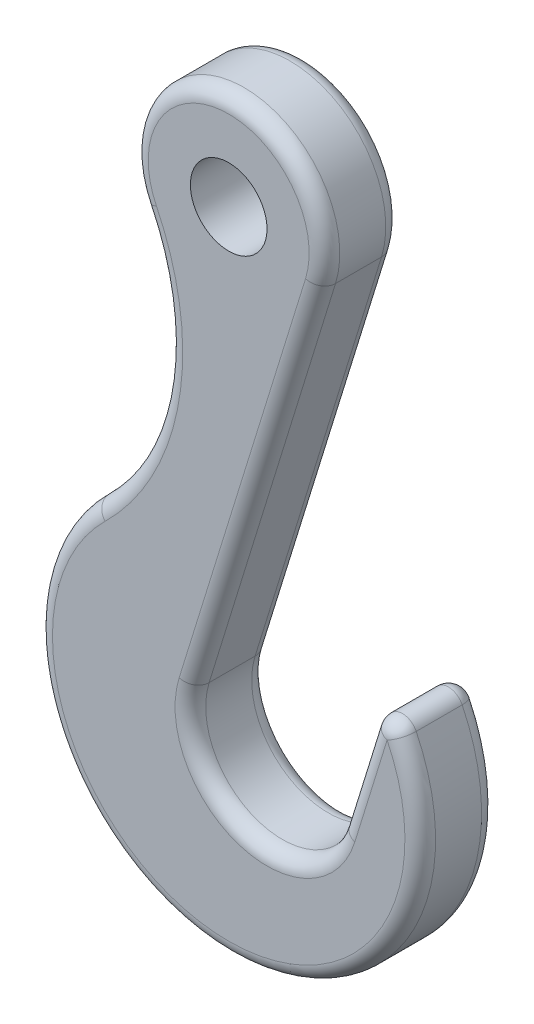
ISO-10303-21;
HEADER;
FILE_DESCRIPTION(('STEP AP214'),'2;1');
FILE_NAME('part.step','',(''),(''),'','','');
FILE_SCHEMA(('AUTOMOTIVE_DESIGN { 1 0 10303 214 1 1 1 1 }'));
ENDSEC;
DATA;
#1=APPLICATION_CONTEXT('core data for automotive mechanical design processes');
#2=APPLICATION_PROTOCOL_DEFINITION('international standard','automotive_design',2000,#1);
#3=PRODUCT_CONTEXT('',#1,'mechanical');
#4=PRODUCT('Part','Part','',(#3));
#5=PRODUCT_RELATED_PRODUCT_CATEGORY('part','',(#4));
#6=PRODUCT_DEFINITION_FORMATION('','',#4);
#7=PRODUCT_DEFINITION_CONTEXT('part definition',#1,'design');
#8=PRODUCT_DEFINITION('design','',#6,#7);
#9=PRODUCT_DEFINITION_SHAPE('','',#8);
#10=(LENGTH_UNIT() NAMED_UNIT(*) SI_UNIT(.MILLI.,.METRE.));
#11=(NAMED_UNIT(*) PLANE_ANGLE_UNIT() SI_UNIT($,.RADIAN.));
#12=(NAMED_UNIT(*) SI_UNIT($,.STERADIAN.) SOLID_ANGLE_UNIT());
#13=UNCERTAINTY_MEASURE_WITH_UNIT(LENGTH_MEASURE(1.E-05),#10,'distance_accuracy_value','');
#14=(GEOMETRIC_REPRESENTATION_CONTEXT(3) GLOBAL_UNCERTAINTY_ASSIGNED_CONTEXT((#13)) GLOBAL_UNIT_ASSIGNED_CONTEXT((#10,
#11,#12)) REPRESENTATION_CONTEXT('',''));
#15=CARTESIAN_POINT('',(0.,0.,0.));
#16=DIRECTION('',(0.,0.,1.));
#17=DIRECTION('',(1.,0.,0.));
#18=AXIS2_PLACEMENT_3D('',#15,#16,#17);
#19=CARTESIAN_POINT('',(0.,60.,10.));
#20=DIRECTION('',(0.,0.,1.));
#21=DIRECTION('',(1.,0.,0.));
#22=AXIS2_PLACEMENT_3D('',#19,#20,#21);
#23=PLANE('',#22);
#24=CARTESIAN_POINT('',(0.,0.,10.));
#25=DIRECTION('',(0.,0.,1.));
#26=DIRECTION('',(1.,0.,0.));
#27=AXIS2_PLACEMENT_3D('',#24,#25,#26);
#28=CIRCLE('',#27,23.);
#29=CARTESIAN_POINT('',(-16.1203186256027,16.4053444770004,10.));
#30=VERTEX_POINT('',#29);
#31=CARTESIAN_POINT('',(20.6756526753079,10.0755836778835,10.));
#32=VERTEX_POINT('',#31);
#33=EDGE_CURVE('E49',#30,#32,#28,.T.);
#34=ORIENTED_EDGE('',*,*,#33,.T.);
#35=DIRECTION('',(-0.295385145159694,-0.955378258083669,0.));
#36=VECTOR('',#35,1.);
#37=CARTESIAN_POINT('',(16.464539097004,-3.54462174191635,10.));
#38=LINE('',#37,#36);
#39=CARTESIAN_POINT('',(16.464539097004,-3.54462174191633,10.));
#40=VERTEX_POINT('',#39);
#41=EDGE_CURVE('E190',#32,#40,#38,.T.);
#42=ORIENTED_EDGE('',*,*,#41,.T.);
#43=CARTESIAN_POINT('',(5.,0.,10.));
#44=DIRECTION('',(0.,0.,1.));
#45=DIRECTION('',(1.,0.,0.));
#46=AXIS2_PLACEMENT_3D('',#43,#44,#45);
#47=CIRCLE('',#46,12.);
#48=CARTESIAN_POINT('',(-6.46453909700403,3.54462174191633,10.));
#49=VERTEX_POINT('',#48);
#50=EDGE_CURVE('E198',#40,#49,#47,.F.);
#51=ORIENTED_EDGE('',*,*,#50,.T.);
#52=DIRECTION('',(0.295385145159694,0.955378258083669,0.));
#53=VECTOR('',#52,1.);
#54=CARTESIAN_POINT('',(10.0314717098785,56.8984559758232,10.));
#55=LINE('',#54,#53);
#56=CARTESIAN_POINT('',(10.0314717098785,56.8984559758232,10.));
#57=VERTEX_POINT('',#56);
#58=EDGE_CURVE('E196',#49,#57,#55,.T.);
#59=ORIENTED_EDGE('',*,*,#58,.T.);
#60=CARTESIAN_POINT('',(0.,60.,10.));
#61=DIRECTION('',(0.,0.,1.));
#62=DIRECTION('',(1.,0.,0.));
#63=AXIS2_PLACEMENT_3D('',#60,#61,#62);
#64=CIRCLE('',#63,10.5);
#65=CARTESIAN_POINT('',(-9.43422721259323,55.3907314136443,10.));
#66=VERTEX_POINT('',#65);
#67=EDGE_CURVE('E194',#57,#66,#64,.T.);
#68=ORIENTED_EDGE('',*,*,#67,.T.);
#69=CARTESIAN_POINT('',(-39.8340274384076,40.5383390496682,10.));
#70=DIRECTION('',(0.,0.,1.));
#71=DIRECTION('',(1.,0.,0.));
#72=AXIS2_PLACEMENT_3D('',#69,#70,#71);
#73=CIRCLE('',#72,33.8340274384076);
#74=EDGE_CURVE('E54',#66,#30,#73,.F.);
#75=ORIENTED_EDGE('',*,*,#74,.T.);
#76=EDGE_LOOP('',(#34,#42,#51,#59,#68,#75));
#77=FACE_BOUND('',#76,.T.);
#78=CARTESIAN_POINT('',(0.,60.,10.));
#79=DIRECTION('',(0.,0.,1.));
#80=DIRECTION('',(1.,0.,0.));
#81=AXIS2_PLACEMENT_3D('',#78,#79,#80);
#82=CIRCLE('',#81,5.);
#83=CARTESIAN_POINT('',(5.,60.,10.));
#84=VERTEX_POINT('',#83);
#85=EDGE_CURVE('E248',#84,#84,#82,.T.);
#86=ORIENTED_EDGE('',*,*,#85,.F.);
#87=EDGE_LOOP('',(#86));
#88=FACE_BOUND('',#87,.T.);
#89=ADVANCED_FACE('F32',(#77,#88),#23,.T.);
#90=CARTESIAN_POINT('',(0.,60.,0.));
#91=DIRECTION('',(0.,0.,1.));
#92=DIRECTION('',(1.,0.,0.));
#93=AXIS2_PLACEMENT_3D('',#90,#91,#92);
#94=PLANE('',#93);
#95=CARTESIAN_POINT('',(0.,0.,0.));
#96=DIRECTION('',(0.,0.,1.));
#97=DIRECTION('',(1.,0.,0.));
#98=AXIS2_PLACEMENT_3D('',#95,#96,#97);
#99=CIRCLE('',#98,23.);
#100=CARTESIAN_POINT('',(20.6756526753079,10.0755836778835,0.));
#101=VERTEX_POINT('',#100);
#102=CARTESIAN_POINT('',(-16.1203186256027,16.4053444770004,0.));
#103=VERTEX_POINT('',#102);
#104=EDGE_CURVE('E232',#101,#103,#99,.F.);
#105=ORIENTED_EDGE('',*,*,#104,.T.);
#106=CARTESIAN_POINT('',(-39.8340274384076,40.5383390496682,0.));
#107=DIRECTION('',(0.,0.,1.));
#108=DIRECTION('',(1.,0.,0.));
#109=AXIS2_PLACEMENT_3D('',#106,#107,#108);
#110=CIRCLE('',#109,33.8340274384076);
#111=CARTESIAN_POINT('',(-9.43422721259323,55.3907314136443,0.));
#112=VERTEX_POINT('',#111);
#113=EDGE_CURVE('E221',#103,#112,#110,.T.);
#114=ORIENTED_EDGE('',*,*,#113,.T.);
#115=CARTESIAN_POINT('',(0.,60.,0.));
#116=DIRECTION('',(0.,0.,1.));
#117=DIRECTION('',(1.,0.,0.));
#118=AXIS2_PLACEMENT_3D('',#115,#116,#117);
#119=CIRCLE('',#118,10.5);
#120=CARTESIAN_POINT('',(10.0314717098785,56.8984559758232,0.));
#121=VERTEX_POINT('',#120);
#122=EDGE_CURVE('E224',#112,#121,#119,.F.);
#123=ORIENTED_EDGE('',*,*,#122,.T.);
#124=DIRECTION('',(0.295385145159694,0.955378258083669,0.));
#125=VECTOR('',#124,1.);
#126=CARTESIAN_POINT('',(10.0314717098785,56.8984559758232,0.));
#127=LINE('',#126,#125);
#128=CARTESIAN_POINT('',(-6.46453909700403,3.54462174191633,0.));
#129=VERTEX_POINT('',#128);
#130=EDGE_CURVE('E226',#121,#129,#127,.F.);
#131=ORIENTED_EDGE('',*,*,#130,.T.);
#132=CARTESIAN_POINT('',(5.,0.,0.));
#133=DIRECTION('',(0.,0.,1.));
#134=DIRECTION('',(1.,0.,0.));
#135=AXIS2_PLACEMENT_3D('',#132,#133,#134);
#136=CIRCLE('',#135,12.);
#137=CARTESIAN_POINT('',(16.464539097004,-3.54462174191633,0.));
#138=VERTEX_POINT('',#137);
#139=EDGE_CURVE('E228',#129,#138,#136,.T.);
#140=ORIENTED_EDGE('',*,*,#139,.T.);
#141=DIRECTION('',(-0.295385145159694,-0.955378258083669,0.));
#142=VECTOR('',#141,1.);
#143=CARTESIAN_POINT('',(32.9605499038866,49.8092124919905,0.));
#144=LINE('',#143,#142);
#145=EDGE_CURVE('E230',#138,#101,#144,.F.);
#146=ORIENTED_EDGE('',*,*,#145,.T.);
#147=EDGE_LOOP('',(#105,#114,#123,#131,#140,#146));
#148=FACE_BOUND('',#147,.T.);
#149=CARTESIAN_POINT('',(0.,60.,0.));
#150=DIRECTION('',(0.,0.,1.));
#151=DIRECTION('',(1.,0.,0.));
#152=AXIS2_PLACEMENT_3D('',#149,#150,#151);
#153=CIRCLE('',#152,5.);
#154=CARTESIAN_POINT('',(5.,60.,0.));
#155=VERTEX_POINT('',#154);
#156=EDGE_CURVE('E173',#155,#155,#153,.T.);
#157=ORIENTED_EDGE('',*,*,#156,.T.);
#158=EDGE_LOOP('',(#157));
#159=FACE_BOUND('',#158,.T.);
#160=ADVANCED_FACE('F258',(#148,#159),#94,.F.);
#161=CARTESIAN_POINT('',(0.,60.,10.));
#162=DIRECTION('',(0.,0.,-1.));
#163=DIRECTION('',(-1.,0.,0.));
#164=AXIS2_PLACEMENT_3D('',#161,#162,#163);
#165=CYLINDRICAL_SURFACE('',#164,12.5);
#166=DIRECTION('',(0.,0.,-1.));
#167=VECTOR('',#166,1.);
#168=CARTESIAN_POINT('',(11.9422282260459,56.3076856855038,10.));
#169=LINE('',#168,#167);
#170=CARTESIAN_POINT('',(11.9422282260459,56.3076856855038,8.));
#171=VERTEX_POINT('',#170);
#172=CARTESIAN_POINT('',(11.9422282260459,56.3076856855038,2.));
#173=VERTEX_POINT('',#172);
#174=EDGE_CURVE('E245',#171,#173,#169,.T.);
#175=ORIENTED_EDGE('',*,*,#174,.T.);
#176=CARTESIAN_POINT('',(0.,60.,2.));
#177=DIRECTION('',(0.,0.,1.));
#178=DIRECTION('',(1.,0.,0.));
#179=AXIS2_PLACEMENT_3D('',#176,#177,#178);
#180=CIRCLE('',#179,12.5);
#181=CARTESIAN_POINT('',(-11.2312228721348,54.5127754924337,2.));
#182=VERTEX_POINT('',#181);
#183=EDGE_CURVE('E217',#173,#182,#180,.T.);
#184=ORIENTED_EDGE('',*,*,#183,.T.);
#185=DIRECTION('',(0.,0.,-1.));
#186=VECTOR('',#185,1.);
#187=CARTESIAN_POINT('',(-11.2312228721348,54.5127754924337,10.));
#188=LINE('',#187,#186);
#189=CARTESIAN_POINT('',(-11.2312228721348,54.5127754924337,8.));
#190=VERTEX_POINT('',#189);
#191=EDGE_CURVE('E146',#190,#182,#188,.T.);
#192=ORIENTED_EDGE('',*,*,#191,.F.);
#193=CARTESIAN_POINT('',(0.,60.,8.));
#194=DIRECTION('',(0.,0.,1.));
#195=DIRECTION('',(1.,0.,0.));
#196=AXIS2_PLACEMENT_3D('',#193,#194,#195);
#197=CIRCLE('',#196,12.5);
#198=EDGE_CURVE('E219',#190,#171,#197,.F.);
#199=ORIENTED_EDGE('',*,*,#198,.T.);
#200=EDGE_LOOP('',(#175,#184,#192,#199));
#201=FACE_BOUND('',#200,.T.);
#202=ADVANCED_FACE('F263',(#201),#165,.T.);
#203=CARTESIAN_POINT('',(-39.8340274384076,40.5383390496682,10.));
#204=DIRECTION('',(0.,0.,-1.));
#205=DIRECTION('',(-1.,0.,0.));
#206=AXIS2_PLACEMENT_3D('',#203,#204,#205);
#207=CYLINDRICAL_SURFACE('',#206,31.8340274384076);
#208=ORIENTED_EDGE('',*,*,#191,.T.);
#209=CARTESIAN_POINT('',(-39.8340274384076,40.5383390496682,2.));
#210=DIRECTION('',(0.,0.,1.));
#211=DIRECTION('',(1.,0.,0.));
#212=AXIS2_PLACEMENT_3D('',#209,#210,#211);
#213=CIRCLE('',#212,31.8340274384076);
#214=CARTESIAN_POINT('',(-17.5220854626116,17.8318961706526,2.));
#215=VERTEX_POINT('',#214);
#216=EDGE_CURVE('E145',#182,#215,#213,.F.);
#217=ORIENTED_EDGE('',*,*,#216,.T.);
#218=DIRECTION('',(0.,0.,-1.));
#219=VECTOR('',#218,1.);
#220=CARTESIAN_POINT('',(-17.5220854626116,17.8318961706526,10.));
#221=LINE('',#220,#219);
#222=CARTESIAN_POINT('',(-17.5220854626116,17.8318961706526,8.));
#223=VERTEX_POINT('',#222);
#224=EDGE_CURVE('E131',#223,#215,#221,.T.);
#225=ORIENTED_EDGE('',*,*,#224,.F.);
#226=CARTESIAN_POINT('',(-39.8340274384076,40.5383390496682,8.));
#227=DIRECTION('',(0.,0.,1.));
#228=DIRECTION('',(1.,0.,0.));
#229=AXIS2_PLACEMENT_3D('',#226,#227,#228);
#230=CIRCLE('',#229,31.8340274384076);
#231=EDGE_CURVE('E142',#223,#190,#230,.T.);
#232=ORIENTED_EDGE('',*,*,#231,.T.);
#233=EDGE_LOOP('',(#208,#217,#225,#232));
#234=FACE_BOUND('',#233,.T.);
#235=ADVANCED_FACE('F141',(#234),#207,.F.);
#236=CARTESIAN_POINT('',(0.,0.,10.));
#237=DIRECTION('',(0.,0.,-1.));
#238=DIRECTION('',(-1.,0.,0.));
#239=AXIS2_PLACEMENT_3D('',#236,#237,#238);
#240=CYLINDRICAL_SURFACE('',#239,25.);
#241=DIRECTION('',(0.,0.,-1.));
#242=VECTOR('',#241,1.);
#243=CARTESIAN_POINT('',(22.473535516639,10.9517213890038,10.));
#244=LINE('',#243,#242);
#245=CARTESIAN_POINT('',(22.473535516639,10.9517213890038,2.));
#246=VERTEX_POINT('',#245);
#247=CARTESIAN_POINT('',(22.473535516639,10.9517213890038,8.));
#248=VERTEX_POINT('',#247);
#249=EDGE_CURVE('E133',#246,#248,#244,.F.);
#250=ORIENTED_EDGE('',*,*,#249,.T.);
#251=CARTESIAN_POINT('',(0.,0.,8.));
#252=DIRECTION('',(0.,0.,1.));
#253=DIRECTION('',(1.,0.,0.));
#254=AXIS2_PLACEMENT_3D('',#251,#252,#253);
#255=CIRCLE('',#254,25.);
#256=EDGE_CURVE('E11',#248,#223,#255,.F.);
#257=ORIENTED_EDGE('',*,*,#256,.T.);
#258=ORIENTED_EDGE('',*,*,#224,.T.);
#259=CARTESIAN_POINT('',(0.,0.,2.));
#260=DIRECTION('',(0.,0.,1.));
#261=DIRECTION('',(1.,0.,0.));
#262=AXIS2_PLACEMENT_3D('',#259,#260,#261);
#263=CIRCLE('',#262,25.);
#264=EDGE_CURVE('E41',#215,#246,#263,.T.);
#265=ORIENTED_EDGE('',*,*,#264,.T.);
#266=EDGE_LOOP('',(#250,#257,#258,#265));
#267=FACE_BOUND('',#266,.T.);
#268=ADVANCED_FACE('F130',(#267),#240,.T.);
#269=CARTESIAN_POINT('',(14.5537825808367,-2.95385145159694,10.));
#270=DIRECTION('',(0.955378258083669,-0.295385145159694,0.));
#271=DIRECTION('',(0.295385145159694,0.955378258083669,0.));
#272=AXIS2_PLACEMENT_3D('',#269,#270,#271);
#273=PLANE('',#272);
#274=DIRECTION('',(0.,0.,-1.));
#275=VECTOR('',#274,1.);
#276=CARTESIAN_POINT('',(18.7648961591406,10.6663539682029,10.));
#277=LINE('',#276,#275);
#278=CARTESIAN_POINT('',(18.7648961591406,10.6663539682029,8.));
#279=VERTEX_POINT('',#278);
#280=CARTESIAN_POINT('',(18.7648961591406,10.6663539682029,2.));
#281=VERTEX_POINT('',#280);
#282=EDGE_CURVE('E236',#279,#281,#277,.T.);
#283=ORIENTED_EDGE('',*,*,#282,.T.);
#284=DIRECTION('',(-0.295385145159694,-0.955378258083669,0.));
#285=VECTOR('',#284,1.);
#286=CARTESIAN_POINT('',(14.5537825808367,-2.95385145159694,2.));
#287=LINE('',#286,#285);
#288=CARTESIAN_POINT('',(14.5537825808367,-2.95385145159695,2.));
#289=VERTEX_POINT('',#288);
#290=EDGE_CURVE('E204',#281,#289,#287,.T.);
#291=ORIENTED_EDGE('',*,*,#290,.T.);
#292=DIRECTION('',(0.,0.,-1.));
#293=VECTOR('',#292,1.);
#294=CARTESIAN_POINT('',(14.5537825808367,-2.95385145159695,10.));
#295=LINE('',#294,#293);
#296=CARTESIAN_POINT('',(14.5537825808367,-2.95385145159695,8.));
#297=VERTEX_POINT('',#296);
#298=EDGE_CURVE('E147',#297,#289,#295,.T.);
#299=ORIENTED_EDGE('',*,*,#298,.F.);
#300=DIRECTION('',(-0.295385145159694,-0.955378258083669,0.));
#301=VECTOR('',#300,1.);
#302=CARTESIAN_POINT('',(18.7648961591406,10.6663539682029,8.));
#303=LINE('',#302,#301);
#304=EDGE_CURVE('E206',#297,#279,#303,.F.);
#305=ORIENTED_EDGE('',*,*,#304,.T.);
#306=EDGE_LOOP('',(#283,#291,#299,#305));
#307=FACE_BOUND('',#306,.T.);
#308=ADVANCED_FACE('F275',(#307),#273,.F.);
#309=CARTESIAN_POINT('',(5.,0.,10.));
#310=DIRECTION('',(0.,0.,-1.));
#311=DIRECTION('',(-1.,0.,0.));
#312=AXIS2_PLACEMENT_3D('',#309,#310,#311);
#313=CYLINDRICAL_SURFACE('',#312,10.);
#314=ORIENTED_EDGE('',*,*,#298,.T.);
#315=CARTESIAN_POINT('',(5.,0.,2.));
#316=DIRECTION('',(0.,0.,1.));
#317=DIRECTION('',(1.,0.,0.));
#318=AXIS2_PLACEMENT_3D('',#315,#316,#317);
#319=CIRCLE('',#318,10.);
#320=CARTESIAN_POINT('',(-4.55378258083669,2.95385145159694,2.));
#321=VERTEX_POINT('',#320);
#322=EDGE_CURVE('E209',#289,#321,#319,.F.);
#323=ORIENTED_EDGE('',*,*,#322,.T.);
#324=DIRECTION('',(0.,0.,-1.));
#325=VECTOR('',#324,1.);
#326=CARTESIAN_POINT('',(-4.55378258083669,2.95385145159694,10.));
#327=LINE('',#326,#325);
#328=CARTESIAN_POINT('',(-4.55378258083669,2.95385145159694,8.));
#329=VERTEX_POINT('',#328);
#330=EDGE_CURVE('E242',#329,#321,#327,.T.);
#331=ORIENTED_EDGE('',*,*,#330,.F.);
#332=CARTESIAN_POINT('',(5.,0.,8.));
#333=DIRECTION('',(0.,0.,1.));
#334=DIRECTION('',(1.,0.,0.));
#335=AXIS2_PLACEMENT_3D('',#332,#333,#334);
#336=CIRCLE('',#335,10.);
#337=EDGE_CURVE('E211',#329,#297,#336,.T.);
#338=ORIENTED_EDGE('',*,*,#337,.T.);
#339=EDGE_LOOP('',(#314,#323,#331,#338));
#340=FACE_BOUND('',#339,.T.);
#341=ADVANCED_FACE('F271',(#340),#313,.F.);
#342=CARTESIAN_POINT('',(11.9422282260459,56.3076856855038,10.));
#343=DIRECTION('',(-0.955378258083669,0.295385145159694,0.));
#344=DIRECTION('',(-0.295385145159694,-0.955378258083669,0.));
#345=AXIS2_PLACEMENT_3D('',#342,#343,#344);
#346=PLANE('',#345);
#347=ORIENTED_EDGE('',*,*,#330,.T.);
#348=DIRECTION('',(0.295385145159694,0.955378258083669,0.));
#349=VECTOR('',#348,1.);
#350=CARTESIAN_POINT('',(11.9422282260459,56.3076856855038,2.));
#351=LINE('',#350,#349);
#352=EDGE_CURVE('E213',#321,#173,#351,.T.);
#353=ORIENTED_EDGE('',*,*,#352,.T.);
#354=ORIENTED_EDGE('',*,*,#174,.F.);
#355=DIRECTION('',(0.295385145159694,0.955378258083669,0.));
#356=VECTOR('',#355,1.);
#357=CARTESIAN_POINT('',(-4.5537825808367,2.95385145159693,8.));
#358=LINE('',#357,#356);
#359=EDGE_CURVE('E215',#171,#329,#358,.F.);
#360=ORIENTED_EDGE('',*,*,#359,.T.);
#361=EDGE_LOOP('',(#347,#353,#354,#360));
#362=FACE_BOUND('',#361,.T.);
#363=ADVANCED_FACE('F268',(#362),#346,.F.);
#364=CARTESIAN_POINT('',(0.,60.,10.));
#365=DIRECTION('',(0.,0.,-1.));
#366=DIRECTION('',(-1.,0.,0.));
#367=AXIS2_PLACEMENT_3D('',#364,#365,#366);
#368=CYLINDRICAL_SURFACE('',#367,5.);
#369=ORIENTED_EDGE('',*,*,#85,.T.);
#370=EDGE_LOOP('',(#369));
#371=FACE_BOUND('',#370,.T.);
#372=ORIENTED_EDGE('',*,*,#156,.F.);
#373=EDGE_LOOP('',(#372));
#374=FACE_BOUND('',#373,.T.);
#375=ADVANCED_FACE('F254',(#371,#374),#368,.F.);
#376=CARTESIAN_POINT('',(20.6756526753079,10.0755836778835,10.));
#377=DIRECTION('',(0.,0.,-1.));
#378=DIRECTION('',(-1.,0.,0.));
#379=AXIS2_PLACEMENT_3D('',#376,#377,#378);
#380=CYLINDRICAL_SURFACE('',#379,2.);
#381=ORIENTED_EDGE('',*,*,#249,.F.);
#382=CARTESIAN_POINT('',(20.6756526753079,10.0755836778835,2.));
#383=DIRECTION('',(0.,0.,-1.));
#384=DIRECTION('',(-1.,0.,0.));
#385=AXIS2_PLACEMENT_3D('',#382,#383,#384);
#386=CIRCLE('',#385,2.);
#387=EDGE_CURVE('E200',#246,#281,#386,.F.);
#388=ORIENTED_EDGE('',*,*,#387,.T.);
#389=ORIENTED_EDGE('',*,*,#282,.F.);
#390=CARTESIAN_POINT('',(20.6756526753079,10.0755836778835,8.));
#391=DIRECTION('',(0.,0.,-1.));
#392=DIRECTION('',(-1.,0.,0.));
#393=AXIS2_PLACEMENT_3D('',#390,#391,#392);
#394=CIRCLE('',#393,2.);
#395=EDGE_CURVE('E202',#279,#248,#394,.T.);
#396=ORIENTED_EDGE('',*,*,#395,.T.);
#397=EDGE_LOOP('',(#381,#388,#389,#396));
#398=FACE_BOUND('',#397,.T.);
#399=ADVANCED_FACE('F287',(#398),#380,.T.);
#400=CARTESIAN_POINT('',(5.,0.,2.));
#401=DIRECTION('',(0.,0.,1.));
#402=DIRECTION('',(1.,0.,0.));
#403=AXIS2_PLACEMENT_3D('',#400,#401,#402);
#404=TOROIDAL_SURFACE('',#403,12.,2.);
#405=CARTESIAN_POINT('',(-6.46453909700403,3.54462174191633,2.));
#406=DIRECTION('',(0.295385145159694,0.955378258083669,0.));
#407=DIRECTION('',(-0.955378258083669,0.295385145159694,0.));
#408=AXIS2_PLACEMENT_3D('',#405,#406,#407);
#409=CIRCLE('',#408,2.);
#410=EDGE_CURVE('E174',#321,#129,#409,.T.);
#411=ORIENTED_EDGE('',*,*,#410,.F.);
#412=ORIENTED_EDGE('',*,*,#322,.F.);
#413=CARTESIAN_POINT('',(16.464539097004,-3.54462174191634,2.));
#414=DIRECTION('',(0.295385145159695,0.955378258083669,0.));
#415=DIRECTION('',(-0.955378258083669,0.295385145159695,0.));
#416=AXIS2_PLACEMENT_3D('',#413,#414,#415);
#417=CIRCLE('',#416,2.);
#418=EDGE_CURVE('E170',#138,#289,#417,.T.);
#419=ORIENTED_EDGE('',*,*,#418,.F.);
#420=ORIENTED_EDGE('',*,*,#139,.F.);
#421=EDGE_LOOP('',(#411,#412,#419,#420));
#422=FACE_BOUND('',#421,.T.);
#423=ADVANCED_FACE('F290',(#422),#404,.T.);
#424=CARTESIAN_POINT('',(16.464539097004,-3.54462174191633,2.));
#425=DIRECTION('',(-0.295385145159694,-0.955378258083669,0.));
#426=DIRECTION('',(0.955378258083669,-0.295385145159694,0.));
#427=AXIS2_PLACEMENT_3D('',#424,#425,#426);
#428=CYLINDRICAL_SURFACE('',#427,2.);
#429=ORIENTED_EDGE('',*,*,#418,.T.);
#430=ORIENTED_EDGE('',*,*,#290,.F.);
#431=CARTESIAN_POINT('',(20.6756526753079,10.0755836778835,2.));
#432=DIRECTION('',(0.295385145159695,0.955378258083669,0.));
#433=DIRECTION('',(-0.955378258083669,0.295385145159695,0.));
#434=AXIS2_PLACEMENT_3D('',#431,#432,#433);
#435=CIRCLE('',#434,2.);
#436=EDGE_CURVE('E177',#101,#281,#435,.T.);
#437=ORIENTED_EDGE('',*,*,#436,.F.);
#438=ORIENTED_EDGE('',*,*,#145,.F.);
#439=EDGE_LOOP('',(#429,#430,#437,#438));
#440=FACE_BOUND('',#439,.T.);
#441=ADVANCED_FACE('F311',(#440),#428,.T.);
#442=CARTESIAN_POINT('',(10.0314717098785,56.8984559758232,2.));
#443=DIRECTION('',(0.295385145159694,0.955378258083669,0.));
#444=DIRECTION('',(-0.955378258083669,0.295385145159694,0.));
#445=AXIS2_PLACEMENT_3D('',#442,#443,#444);
#446=CYLINDRICAL_SURFACE('',#445,2.);
#447=ORIENTED_EDGE('',*,*,#410,.T.);
#448=ORIENTED_EDGE('',*,*,#130,.F.);
#449=CARTESIAN_POINT('',(10.0314717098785,56.8984559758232,2.));
#450=DIRECTION('',(0.295385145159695,0.955378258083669,0.));
#451=DIRECTION('',(-0.955378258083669,0.295385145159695,0.));
#452=AXIS2_PLACEMENT_3D('',#449,#450,#451);
#453=CIRCLE('',#452,2.);
#454=EDGE_CURVE('E180',#173,#121,#453,.T.);
#455=ORIENTED_EDGE('',*,*,#454,.F.);
#456=ORIENTED_EDGE('',*,*,#352,.F.);
#457=EDGE_LOOP('',(#447,#448,#455,#456));
#458=FACE_BOUND('',#457,.T.);
#459=ADVANCED_FACE('F307',(#458),#446,.T.);
#460=CARTESIAN_POINT('',(20.6756526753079,10.0755836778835,2.));
#461=DIRECTION('',(0.,0.,1.));
#462=DIRECTION('',(1.,0.,0.));
#463=AXIS2_PLACEMENT_3D('',#460,#461,#462);
#464=SPHERICAL_SURFACE('',#463,2.);
#465=ORIENTED_EDGE('',*,*,#436,.T.);
#466=ORIENTED_EDGE('',*,*,#387,.F.);
#467=CARTESIAN_POINT('',(20.6756526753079,10.0755836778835,2.));
#468=DIRECTION('',(0.438068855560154,-0.898941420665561,0.));
#469=DIRECTION('',(0.898941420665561,0.438068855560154,0.));
#470=AXIS2_PLACEMENT_3D('',#467,#468,#469);
#471=CIRCLE('',#470,2.);
#472=EDGE_CURVE('E183',#101,#246,#471,.T.);
#473=ORIENTED_EDGE('',*,*,#472,.F.);
#474=EDGE_LOOP('',(#465,#466,#473));
#475=FACE_BOUND('',#474,.T.);
#476=ADVANCED_FACE('F303',(#475),#464,.T.);
#477=CARTESIAN_POINT('',(0.,60.,2.));
#478=DIRECTION('',(0.,0.,1.));
#479=DIRECTION('',(1.,0.,0.));
#480=AXIS2_PLACEMENT_3D('',#477,#478,#479);
#481=TOROIDAL_SURFACE('',#480,10.5,2.);
#482=ORIENTED_EDGE('',*,*,#454,.T.);
#483=ORIENTED_EDGE('',*,*,#122,.F.);
#484=CARTESIAN_POINT('',(-9.43422721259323,55.3907314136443,2.));
#485=DIRECTION('',(0.438977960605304,-0.898497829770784,0.));
#486=DIRECTION('',(0.898497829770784,0.438977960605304,0.));
#487=AXIS2_PLACEMENT_3D('',#484,#485,#486);
#488=CIRCLE('',#487,2.);
#489=EDGE_CURVE('E186',#182,#112,#488,.T.);
#490=ORIENTED_EDGE('',*,*,#489,.F.);
#491=ORIENTED_EDGE('',*,*,#183,.F.);
#492=EDGE_LOOP('',(#482,#483,#490,#491));
#493=FACE_BOUND('',#492,.T.);
#494=ADVANCED_FACE('F299',(#493),#481,.T.);
#495=CARTESIAN_POINT('',(0.,0.,2.));
#496=DIRECTION('',(0.,0.,1.));
#497=DIRECTION('',(1.,0.,0.));
#498=AXIS2_PLACEMENT_3D('',#495,#496,#497);
#499=TOROIDAL_SURFACE('',#498,23.,2.);
#500=ORIENTED_EDGE('',*,*,#472,.T.);
#501=ORIENTED_EDGE('',*,*,#264,.F.);
#502=CARTESIAN_POINT('',(-16.1203186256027,16.4053444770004,2.));
#503=DIRECTION('',(0.713275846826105,0.700883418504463,0.));
#504=DIRECTION('',(-0.700883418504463,0.713275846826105,0.));
#505=AXIS2_PLACEMENT_3D('',#502,#503,#504);
#506=CIRCLE('',#505,2.);
#507=EDGE_CURVE('E157',#103,#215,#506,.T.);
#508=ORIENTED_EDGE('',*,*,#507,.F.);
#509=ORIENTED_EDGE('',*,*,#104,.F.);
#510=EDGE_LOOP('',(#500,#501,#508,#509));
#511=FACE_BOUND('',#510,.T.);
#512=ADVANCED_FACE('F295',(#511),#499,.T.);
#513=CARTESIAN_POINT('',(-39.8340274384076,40.5383390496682,2.));
#514=DIRECTION('',(0.,0.,1.));
#515=DIRECTION('',(1.,0.,0.));
#516=AXIS2_PLACEMENT_3D('',#513,#514,#515);
#517=TOROIDAL_SURFACE('',#516,33.8340274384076,2.);
#518=ORIENTED_EDGE('',*,*,#489,.T.);
#519=ORIENTED_EDGE('',*,*,#113,.F.);
#520=ORIENTED_EDGE('',*,*,#507,.T.);
#521=ORIENTED_EDGE('',*,*,#216,.F.);
#522=EDGE_LOOP('',(#518,#519,#520,#521));
#523=FACE_BOUND('',#522,.T.);
#524=ADVANCED_FACE('F292',(#523),#517,.T.);
#525=CARTESIAN_POINT('',(-39.8340274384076,40.5383390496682,8.));
#526=DIRECTION('',(0.,0.,1.));
#527=DIRECTION('',(1.,0.,0.));
#528=AXIS2_PLACEMENT_3D('',#525,#526,#527);
#529=TOROIDAL_SURFACE('',#528,33.8340274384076,2.);
#530=CARTESIAN_POINT('',(-16.1203186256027,16.4053444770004,8.));
#531=DIRECTION('',(-0.713275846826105,-0.700883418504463,0.));
#532=DIRECTION('',(0.700883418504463,-0.713275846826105,0.));
#533=AXIS2_PLACEMENT_3D('',#530,#531,#532);
#534=CIRCLE('',#533,2.);
#535=EDGE_CURVE('E151',#30,#223,#534,.T.);
#536=ORIENTED_EDGE('',*,*,#535,.F.);
#537=ORIENTED_EDGE('',*,*,#74,.F.);
#538=CARTESIAN_POINT('',(-9.43422721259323,55.3907314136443,8.));
#539=DIRECTION('',(-0.438977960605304,0.898497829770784,0.));
#540=DIRECTION('',(-0.898497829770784,-0.438977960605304,0.));
#541=AXIS2_PLACEMENT_3D('',#538,#539,#540);
#542=CIRCLE('',#541,2.);
#543=EDGE_CURVE('E36',#190,#66,#542,.T.);
#544=ORIENTED_EDGE('',*,*,#543,.F.);
#545=ORIENTED_EDGE('',*,*,#231,.F.);
#546=EDGE_LOOP('',(#536,#537,#544,#545));
#547=FACE_BOUND('',#546,.T.);
#548=ADVANCED_FACE('F34',(#547),#529,.T.);
#549=CARTESIAN_POINT('',(0.,60.,8.));
#550=DIRECTION('',(0.,0.,1.));
#551=DIRECTION('',(1.,0.,0.));
#552=AXIS2_PLACEMENT_3D('',#549,#550,#551);
#553=TOROIDAL_SURFACE('',#552,10.5,2.);
#554=ORIENTED_EDGE('',*,*,#543,.T.);
#555=ORIENTED_EDGE('',*,*,#67,.F.);
#556=CARTESIAN_POINT('',(10.0314717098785,56.8984559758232,8.));
#557=DIRECTION('',(-0.295385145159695,-0.955378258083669,0.));
#558=DIRECTION('',(0.955378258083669,-0.295385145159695,0.));
#559=AXIS2_PLACEMENT_3D('',#556,#557,#558);
#560=CIRCLE('',#559,2.);
#561=EDGE_CURVE('E156',#171,#57,#560,.T.);
#562=ORIENTED_EDGE('',*,*,#561,.F.);
#563=ORIENTED_EDGE('',*,*,#198,.F.);
#564=EDGE_LOOP('',(#554,#555,#562,#563));
#565=FACE_BOUND('',#564,.T.);
#566=ADVANCED_FACE('F336',(#565),#553,.T.);
#567=CARTESIAN_POINT('',(0.,0.,8.));
#568=DIRECTION('',(0.,0.,1.));
#569=DIRECTION('',(1.,0.,0.));
#570=AXIS2_PLACEMENT_3D('',#567,#568,#569);
#571=TOROIDAL_SURFACE('',#570,23.,2.);
#572=ORIENTED_EDGE('',*,*,#535,.T.);
#573=ORIENTED_EDGE('',*,*,#256,.F.);
#574=CARTESIAN_POINT('',(20.6756526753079,10.0755836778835,8.));
#575=DIRECTION('',(-0.438068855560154,0.898941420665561,0.));
#576=DIRECTION('',(-0.898941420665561,-0.438068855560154,0.));
#577=AXIS2_PLACEMENT_3D('',#574,#575,#576);
#578=CIRCLE('',#577,2.);
#579=EDGE_CURVE('E159',#32,#248,#578,.T.);
#580=ORIENTED_EDGE('',*,*,#579,.F.);
#581=ORIENTED_EDGE('',*,*,#33,.F.);
#582=EDGE_LOOP('',(#572,#573,#580,#581));
#583=FACE_BOUND('',#582,.T.);
#584=ADVANCED_FACE('F155',(#583),#571,.T.);
#585=CARTESIAN_POINT('',(10.0314717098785,56.8984559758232,8.));
#586=DIRECTION('',(-0.295385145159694,-0.955378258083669,0.));
#587=DIRECTION('',(0.955378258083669,-0.295385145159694,0.));
#588=AXIS2_PLACEMENT_3D('',#585,#586,#587);
#589=CYLINDRICAL_SURFACE('',#588,2.);
#590=ORIENTED_EDGE('',*,*,#561,.T.);
#591=ORIENTED_EDGE('',*,*,#58,.F.);
#592=CARTESIAN_POINT('',(-6.46453909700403,3.54462174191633,8.));
#593=DIRECTION('',(-0.295385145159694,-0.955378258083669,0.));
#594=DIRECTION('',(0.955378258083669,-0.295385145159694,0.));
#595=AXIS2_PLACEMENT_3D('',#592,#593,#594);
#596=CIRCLE('',#595,2.);
#597=EDGE_CURVE('E163',#329,#49,#596,.T.);
#598=ORIENTED_EDGE('',*,*,#597,.F.);
#599=ORIENTED_EDGE('',*,*,#359,.F.);
#600=EDGE_LOOP('',(#590,#591,#598,#599));
#601=FACE_BOUND('',#600,.T.);
#602=ADVANCED_FACE('F330',(#601),#589,.T.);
#603=CARTESIAN_POINT('',(20.6756526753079,10.0755836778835,8.));
#604=DIRECTION('',(0.,0.,1.));
#605=DIRECTION('',(1.,0.,0.));
#606=AXIS2_PLACEMENT_3D('',#603,#604,#605);
#607=SPHERICAL_SURFACE('',#606,2.);
#608=ORIENTED_EDGE('',*,*,#579,.T.);
#609=ORIENTED_EDGE('',*,*,#395,.F.);
#610=CARTESIAN_POINT('',(20.6756526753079,10.0755836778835,8.));
#611=DIRECTION('',(-0.295385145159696,-0.955378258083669,0.));
#612=DIRECTION('',(0.955378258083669,-0.295385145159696,0.));
#613=AXIS2_PLACEMENT_3D('',#610,#611,#612);
#614=CIRCLE('',#613,2.);
#615=EDGE_CURVE('E166',#32,#279,#614,.T.);
#616=ORIENTED_EDGE('',*,*,#615,.F.);
#617=EDGE_LOOP('',(#608,#609,#616));
#618=FACE_BOUND('',#617,.T.);
#619=ADVANCED_FACE('F326',(#618),#607,.T.);
#620=CARTESIAN_POINT('',(5.,0.,8.));
#621=DIRECTION('',(0.,0.,1.));
#622=DIRECTION('',(1.,0.,0.));
#623=AXIS2_PLACEMENT_3D('',#620,#621,#622);
#624=TOROIDAL_SURFACE('',#623,12.,2.);
#625=ORIENTED_EDGE('',*,*,#597,.T.);
#626=ORIENTED_EDGE('',*,*,#50,.F.);
#627=CARTESIAN_POINT('',(16.464539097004,-3.54462174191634,8.));
#628=DIRECTION('',(0.295385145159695,0.955378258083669,0.));
#629=DIRECTION('',(-0.955378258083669,0.295385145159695,0.));
#630=AXIS2_PLACEMENT_3D('',#627,#628,#629);
#631=CIRCLE('',#630,2.);
#632=EDGE_CURVE('E168',#297,#40,#631,.T.);
#633=ORIENTED_EDGE('',*,*,#632,.F.);
#634=ORIENTED_EDGE('',*,*,#337,.F.);
#635=EDGE_LOOP('',(#625,#626,#633,#634));
#636=FACE_BOUND('',#635,.T.);
#637=ADVANCED_FACE('F322',(#636),#624,.T.);
#638=CARTESIAN_POINT('',(32.9605499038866,49.8092124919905,8.));
#639=DIRECTION('',(0.295385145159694,0.955378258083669,0.));
#640=DIRECTION('',(-0.955378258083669,0.295385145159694,0.));
#641=AXIS2_PLACEMENT_3D('',#638,#639,#640);
#642=CYLINDRICAL_SURFACE('',#641,2.);
#643=ORIENTED_EDGE('',*,*,#615,.T.);
#644=ORIENTED_EDGE('',*,*,#304,.F.);
#645=ORIENTED_EDGE('',*,*,#632,.T.);
#646=ORIENTED_EDGE('',*,*,#41,.F.);
#647=EDGE_LOOP('',(#643,#644,#645,#646));
#648=FACE_BOUND('',#647,.T.);
#649=ADVANCED_FACE('F319',(#648),#642,.T.);
#650=CLOSED_SHELL('',(#89,#160,#202,#235,#268,#308,#341,#363,#375,#399,#423,#441,#459,#476,#494,
#512,#524,#548,#566,#584,#602,#619,#637,#649));
#651=MANIFOLD_SOLID_BREP('B2',#650);
#652=ADVANCED_BREP_SHAPE_REPRESENTATION('',(#18,#651),#14);
#653=SHAPE_DEFINITION_REPRESENTATION(#9,#652);
ENDSEC;
END-ISO-10303-21;
